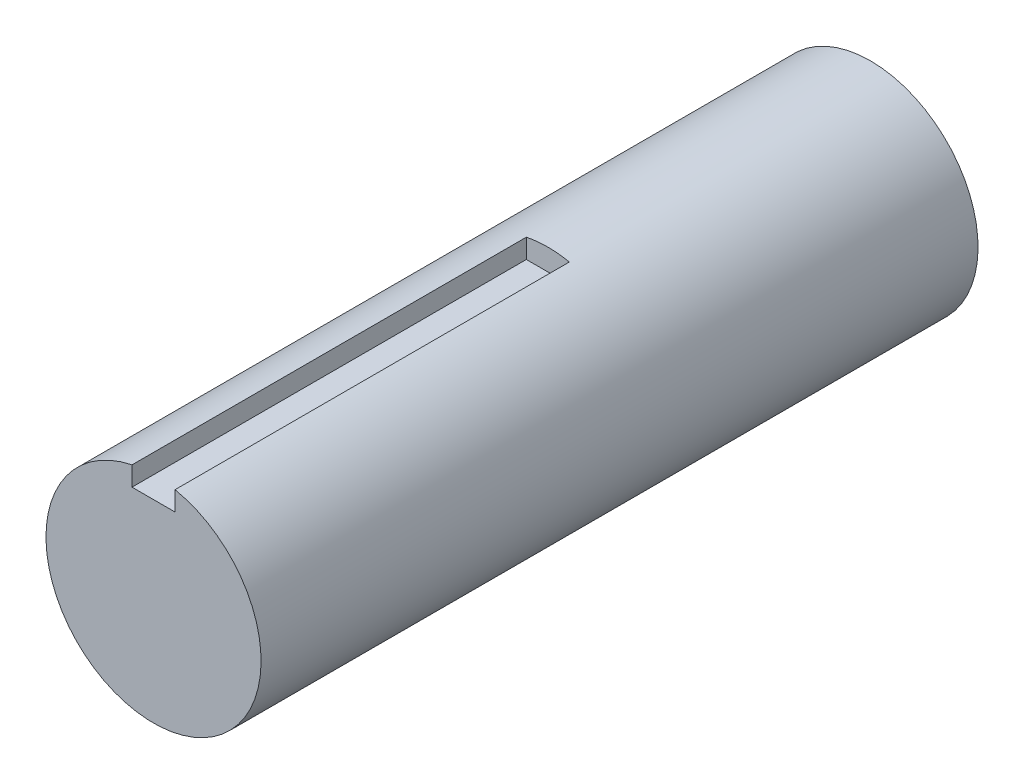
ISO-10303-21;
HEADER;
FILE_DESCRIPTION(('STEP AP214'),'2;1');
FILE_NAME('part.step','',(''),(''),'','','');
FILE_SCHEMA(('AUTOMOTIVE_DESIGN { 1 0 10303 214 1 1 1 1 }'));
ENDSEC;
DATA;
#1=APPLICATION_CONTEXT('core data for automotive mechanical design processes');
#2=APPLICATION_PROTOCOL_DEFINITION('international standard','automotive_design',2000,#1);
#3=PRODUCT_CONTEXT('',#1,'mechanical');
#4=PRODUCT('Part','Part','',(#3));
#5=PRODUCT_RELATED_PRODUCT_CATEGORY('part','',(#4));
#6=PRODUCT_DEFINITION_FORMATION('','',#4);
#7=PRODUCT_DEFINITION_CONTEXT('part definition',#1,'design');
#8=PRODUCT_DEFINITION('design','',#6,#7);
#9=PRODUCT_DEFINITION_SHAPE('','',#8);
#10=(LENGTH_UNIT() NAMED_UNIT(*) SI_UNIT(.MILLI.,.METRE.));
#11=(NAMED_UNIT(*) PLANE_ANGLE_UNIT() SI_UNIT($,.RADIAN.));
#12=(NAMED_UNIT(*) SI_UNIT($,.STERADIAN.) SOLID_ANGLE_UNIT());
#13=UNCERTAINTY_MEASURE_WITH_UNIT(LENGTH_MEASURE(1.E-05),#10,'distance_accuracy_value','');
#14=(GEOMETRIC_REPRESENTATION_CONTEXT(3) GLOBAL_UNCERTAINTY_ASSIGNED_CONTEXT((#13)) GLOBAL_UNIT_ASSIGNED_CONTEXT((#10,
#11,#12)) REPRESENTATION_CONTEXT('',''));
#15=CARTESIAN_POINT('',(0.,0.,0.));
#16=DIRECTION('',(0.,0.,1.));
#17=DIRECTION('',(1.,0.,0.));
#18=AXIS2_PLACEMENT_3D('',#15,#16,#17);
#19=CARTESIAN_POINT('',(0.,0.,0.));
#20=DIRECTION('',(0.,0.,-1.));
#21=DIRECTION('',(0.,1.,0.));
#22=AXIS2_PLACEMENT_3D('',#19,#20,#21);
#23=PLANE('',#22);
#24=CARTESIAN_POINT('',(0.,0.,0.));
#25=DIRECTION('',(0.,0.,-1.));
#26=DIRECTION('',(0.,1.,0.));
#27=AXIS2_PLACEMENT_3D('',#24,#25,#26);
#28=CIRCLE('',#27,15.);
#29=CARTESIAN_POINT('',(0.,15.,0.));
#30=VERTEX_POINT('',#29);
#31=EDGE_CURVE('E102',#30,#30,#28,.T.);
#32=ORIENTED_EDGE('',*,*,#31,.T.);
#33=EDGE_LOOP('',(#32));
#34=FACE_BOUND('',#33,.T.);
#35=ADVANCED_FACE('F32',(#34),#23,.T.);
#36=CARTESIAN_POINT('',(0.,0.,0.));
#37=DIRECTION('',(0.,0.,-1.));
#38=DIRECTION('',(0.,1.,0.));
#39=AXIS2_PLACEMENT_3D('',#36,#37,#38);
#40=CYLINDRICAL_SURFACE('',#39,15.);
#41=DIRECTION('',(0.,0.,-1.));
#42=VECTOR('',#41,1.);
#43=CARTESIAN_POINT('',(3.,14.6969384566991,0.));
#44=LINE('',#43,#42);
#45=CARTESIAN_POINT('',(3.,14.6969384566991,100.));
#46=VERTEX_POINT('',#45);
#47=CARTESIAN_POINT('',(3.,14.6969384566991,45.));
#48=VERTEX_POINT('',#47);
#49=EDGE_CURVE('E54',#46,#48,#44,.T.);
#50=ORIENTED_EDGE('',*,*,#49,.F.);
#51=CARTESIAN_POINT('',(0.,0.,100.));
#52=DIRECTION('',(0.,0.,-1.));
#53=DIRECTION('',(0.,1.,0.));
#54=AXIS2_PLACEMENT_3D('',#51,#52,#53);
#55=CIRCLE('',#54,15.);
#56=CARTESIAN_POINT('',(-3.,14.6969384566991,100.));
#57=VERTEX_POINT('',#56);
#58=EDGE_CURVE('E99',#46,#57,#55,.T.);
#59=ORIENTED_EDGE('',*,*,#58,.T.);
#60=DIRECTION('',(0.,0.,-1.));
#61=VECTOR('',#60,1.);
#62=CARTESIAN_POINT('',(-3.,14.6969384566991,0.));
#63=LINE('',#62,#61);
#64=CARTESIAN_POINT('',(-3.,14.6969384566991,45.));
#65=VERTEX_POINT('',#64);
#66=EDGE_CURVE('E46',#65,#57,#63,.F.);
#67=ORIENTED_EDGE('',*,*,#66,.F.);
#68=CARTESIAN_POINT('',(0.,0.,45.));
#69=DIRECTION('',(0.,0.,-1.));
#70=DIRECTION('',(-1.,0.,0.));
#71=AXIS2_PLACEMENT_3D('',#68,#69,#70);
#72=CIRCLE('',#71,15.);
#73=EDGE_CURVE('E11',#48,#65,#72,.F.);
#74=ORIENTED_EDGE('',*,*,#73,.F.);
#75=EDGE_LOOP('',(#50,#59,#67,#74));
#76=FACE_BOUND('',#75,.T.);
#77=ORIENTED_EDGE('',*,*,#31,.F.);
#78=EDGE_LOOP('',(#77));
#79=FACE_BOUND('',#78,.T.);
#80=ADVANCED_FACE('F107',(#76,#79),#40,.T.);
#81=CARTESIAN_POINT('',(0.,0.,100.));
#82=DIRECTION('',(0.,0.,1.));
#83=DIRECTION('',(0.,-1.,0.));
#84=AXIS2_PLACEMENT_3D('',#81,#82,#83);
#85=PLANE('',#84);
#86=DIRECTION('',(0.,1.,0.));
#87=VECTOR('',#86,1.);
#88=CARTESIAN_POINT('',(3.,12.,100.));
#89=LINE('',#88,#87);
#90=CARTESIAN_POINT('',(3.,12.,100.));
#91=VERTEX_POINT('',#90);
#92=EDGE_CURVE('E92',#91,#46,#89,.T.);
#93=ORIENTED_EDGE('',*,*,#92,.F.);
#94=DIRECTION('',(1.,0.,0.));
#95=VECTOR('',#94,1.);
#96=CARTESIAN_POINT('',(-3.,12.,100.));
#97=LINE('',#96,#95);
#98=CARTESIAN_POINT('',(-3.,12.,100.));
#99=VERTEX_POINT('',#98);
#100=EDGE_CURVE('E94',#99,#91,#97,.T.);
#101=ORIENTED_EDGE('',*,*,#100,.F.);
#102=DIRECTION('',(0.,-1.,0.));
#103=VECTOR('',#102,1.);
#104=CARTESIAN_POINT('',(-3.,0.,100.));
#105=LINE('',#104,#103);
#106=EDGE_CURVE('E39',#57,#99,#105,.T.);
#107=ORIENTED_EDGE('',*,*,#106,.F.);
#108=ORIENTED_EDGE('',*,*,#58,.F.);
#109=EDGE_LOOP('',(#93,#101,#107,#108));
#110=FACE_BOUND('',#109,.T.);
#111=ADVANCED_FACE('F109',(#110),#85,.T.);
#112=CARTESIAN_POINT('',(3.,12.,45.));
#113=DIRECTION('',(1.,0.,0.));
#114=DIRECTION('',(0.,0.,-1.));
#115=AXIS2_PLACEMENT_3D('',#112,#113,#114);
#116=PLANE('',#115);
#117=ORIENTED_EDGE('',*,*,#49,.T.);
#118=DIRECTION('',(0.,1.,0.));
#119=VECTOR('',#118,1.);
#120=CARTESIAN_POINT('',(3.,12.,45.));
#121=LINE('',#120,#119);
#122=CARTESIAN_POINT('',(3.,12.,45.));
#123=VERTEX_POINT('',#122);
#124=EDGE_CURVE('E78',#123,#48,#121,.T.);
#125=ORIENTED_EDGE('',*,*,#124,.F.);
#126=DIRECTION('',(0.,0.,1.));
#127=VECTOR('',#126,1.);
#128=CARTESIAN_POINT('',(3.,12.,45.));
#129=LINE('',#128,#127);
#130=EDGE_CURVE('E86',#123,#91,#129,.T.);
#131=ORIENTED_EDGE('',*,*,#130,.T.);
#132=ORIENTED_EDGE('',*,*,#92,.T.);
#133=EDGE_LOOP('',(#117,#125,#131,#132));
#134=FACE_BOUND('',#133,.T.);
#135=ADVANCED_FACE('F115',(#134),#116,.F.);
#136=CARTESIAN_POINT('',(-3.,12.,45.));
#137=DIRECTION('',(0.,-1.,0.));
#138=DIRECTION('',(0.,0.,-1.));
#139=AXIS2_PLACEMENT_3D('',#136,#137,#138);
#140=PLANE('',#139);
#141=ORIENTED_EDGE('',*,*,#100,.T.);
#142=ORIENTED_EDGE('',*,*,#130,.F.);
#143=DIRECTION('',(1.,0.,0.));
#144=VECTOR('',#143,1.);
#145=CARTESIAN_POINT('',(-3.,12.,45.));
#146=LINE('',#145,#144);
#147=CARTESIAN_POINT('',(-3.,12.,45.));
#148=VERTEX_POINT('',#147);
#149=EDGE_CURVE('E76',#148,#123,#146,.T.);
#150=ORIENTED_EDGE('',*,*,#149,.F.);
#151=DIRECTION('',(0.,0.,1.));
#152=VECTOR('',#151,1.);
#153=CARTESIAN_POINT('',(-3.,12.,45.));
#154=LINE('',#153,#152);
#155=EDGE_CURVE('E81',#148,#99,#154,.T.);
#156=ORIENTED_EDGE('',*,*,#155,.T.);
#157=EDGE_LOOP('',(#141,#142,#150,#156));
#158=FACE_BOUND('',#157,.T.);
#159=ADVANCED_FACE('F88',(#158),#140,.F.);
#160=CARTESIAN_POINT('',(-3.,12.,45.));
#161=DIRECTION('',(-1.,0.,0.));
#162=DIRECTION('',(0.,0.,1.));
#163=AXIS2_PLACEMENT_3D('',#160,#161,#162);
#164=PLANE('',#163);
#165=ORIENTED_EDGE('',*,*,#66,.T.);
#166=ORIENTED_EDGE('',*,*,#106,.T.);
#167=ORIENTED_EDGE('',*,*,#155,.F.);
#168=DIRECTION('',(0.,-1.,0.));
#169=VECTOR('',#168,1.);
#170=CARTESIAN_POINT('',(-3.,12.,45.));
#171=LINE('',#170,#169);
#172=EDGE_CURVE('E72',#65,#148,#171,.T.);
#173=ORIENTED_EDGE('',*,*,#172,.F.);
#174=EDGE_LOOP('',(#165,#166,#167,#173));
#175=FACE_BOUND('',#174,.T.);
#176=ADVANCED_FACE('F82',(#175),#164,.F.);
#177=CARTESIAN_POINT('',(0.,0.,45.));
#178=DIRECTION('',(0.,0.,-1.));
#179=DIRECTION('',(-1.,0.,0.));
#180=AXIS2_PLACEMENT_3D('',#177,#178,#179);
#181=PLANE('',#180);
#182=ORIENTED_EDGE('',*,*,#73,.T.);
#183=ORIENTED_EDGE('',*,*,#172,.T.);
#184=ORIENTED_EDGE('',*,*,#149,.T.);
#185=ORIENTED_EDGE('',*,*,#124,.T.);
#186=EDGE_LOOP('',(#182,#183,#184,#185));
#187=FACE_BOUND('',#186,.T.);
#188=ADVANCED_FACE('F74',(#187),#181,.F.);
#189=CLOSED_SHELL('',(#35,#80,#111,#135,#159,#176,#188));
#190=MANIFOLD_SOLID_BREP('B2',#189);
#191=ADVANCED_BREP_SHAPE_REPRESENTATION('',(#18,#190),#14);
#192=SHAPE_DEFINITION_REPRESENTATION(#9,#191);
ENDSEC;
END-ISO-10303-21;
